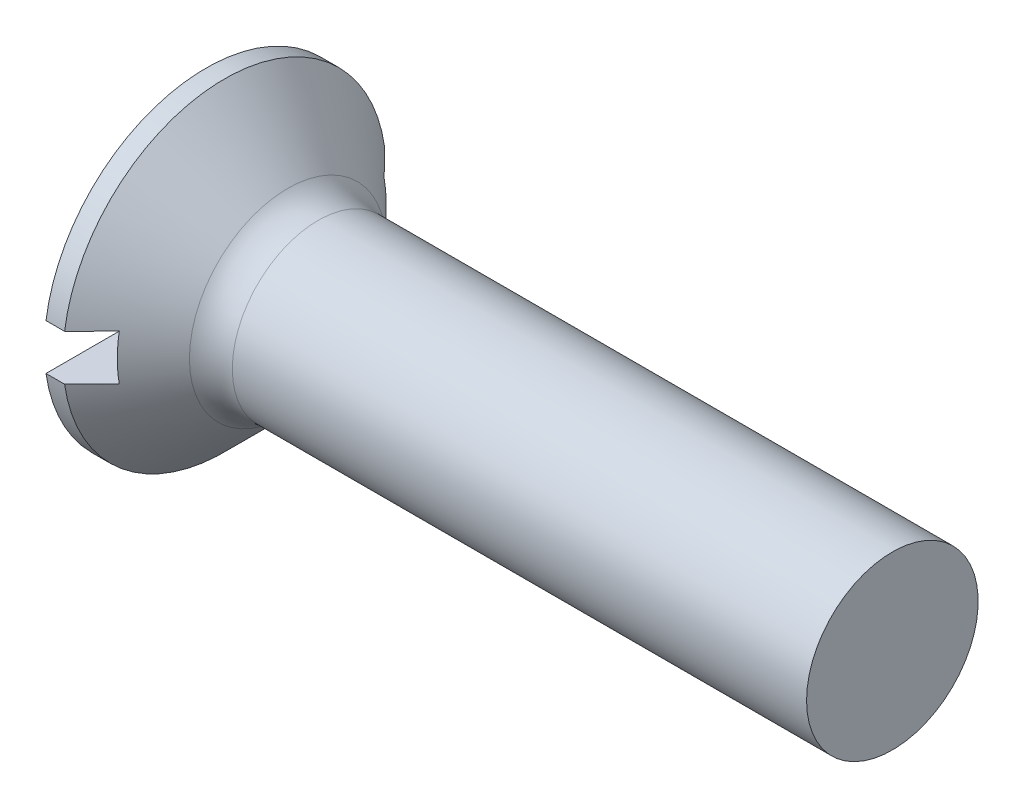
from build123d import *

# Parameters (mm, degrees)
FILLET1_R  = 1.5
SKETCH2_W  = 11.3
SKETCH2_H  = 1.6
SLOT_DEPTH = 1.6


with BuildPart() as part:
    # BodySke → Base-Revolve (revolve)
    with BuildSketch(Plane.XY, mode=Mode.PRIVATE) as base_revolve_sk:
        Polygon((0, 0), (0, 5.65), (0.65, 5.65), (3.3, 3), (24, 3), (24, 0), align=None)
    revolve(base_revolve_sk.sketch.rotate(Axis((-6.35, 0, 0), (1, 0, 0)), 90), axis=Axis((-6.35, 0, 0), (1, 0, 0)))

    # Fillet1
    fillet1_edges = [part.edges().sort_by_distance(p)[0] for p in [
        (3.3, 0, -3),
    ]]
    fillet(fillet1_edges, radius=FILLET1_R)

    # Sketch2 → Slot (cut)
    with BuildSketch(Plane.ZY):
        Rectangle(SKETCH2_W, SKETCH2_H)
    extrude(amount=-SLOT_DEPTH, mode=Mode.SUBTRACT)


solid = part.part
